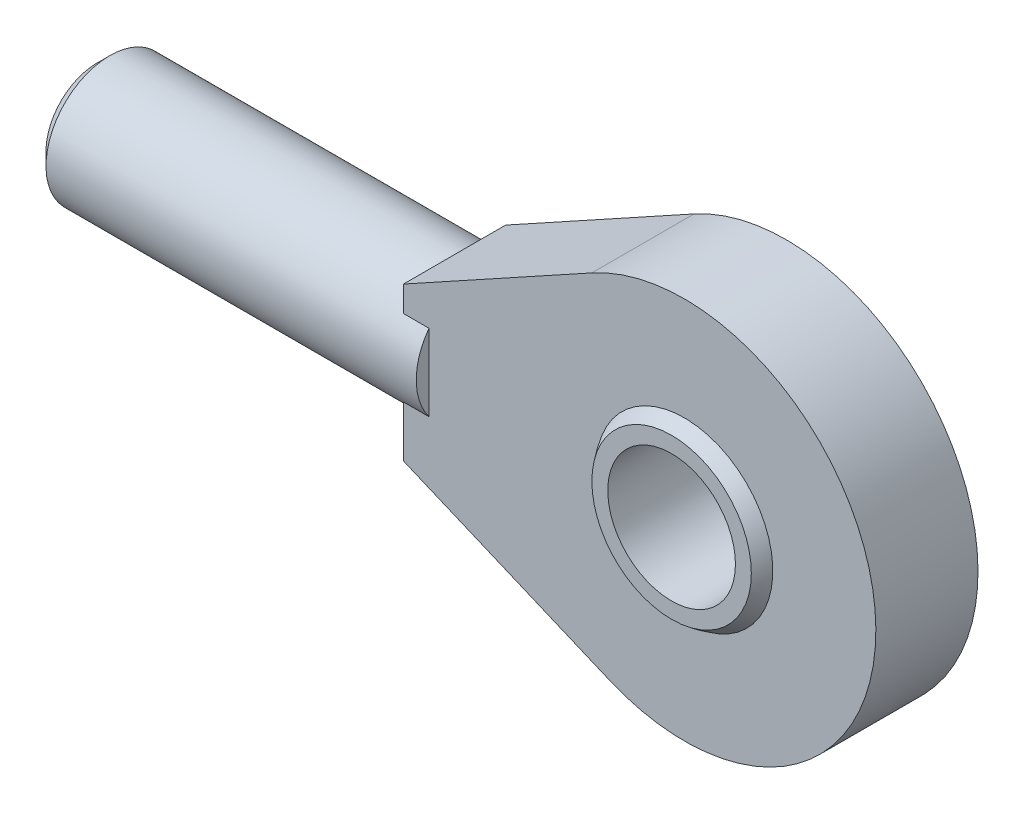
ISO-10303-21;
HEADER;
FILE_DESCRIPTION(('STEP AP214'),'2;1');
FILE_NAME('part.step','',(''),(''),'','','');
FILE_SCHEMA(('AUTOMOTIVE_DESIGN { 1 0 10303 214 1 1 1 1 }'));
ENDSEC;
DATA;
#1=APPLICATION_CONTEXT('core data for automotive mechanical design processes');
#2=APPLICATION_PROTOCOL_DEFINITION('international standard','automotive_design',2000,#1);
#3=PRODUCT_CONTEXT('',#1,'mechanical');
#4=PRODUCT('Part','Part','',(#3));
#5=PRODUCT_RELATED_PRODUCT_CATEGORY('part','',(#4));
#6=PRODUCT_DEFINITION_FORMATION('','',#4);
#7=PRODUCT_DEFINITION_CONTEXT('part definition',#1,'design');
#8=PRODUCT_DEFINITION('design','',#6,#7);
#9=PRODUCT_DEFINITION_SHAPE('','',#8);
#10=(LENGTH_UNIT() NAMED_UNIT(*) SI_UNIT(.MILLI.,.METRE.));
#11=(NAMED_UNIT(*) PLANE_ANGLE_UNIT() SI_UNIT($,.RADIAN.));
#12=(NAMED_UNIT(*) SI_UNIT($,.STERADIAN.) SOLID_ANGLE_UNIT());
#13=UNCERTAINTY_MEASURE_WITH_UNIT(LENGTH_MEASURE(1.E-05),#10,'distance_accuracy_value','');
#14=(GEOMETRIC_REPRESENTATION_CONTEXT(3) GLOBAL_UNCERTAINTY_ASSIGNED_CONTEXT((#13)) GLOBAL_UNIT_ASSIGNED_CONTEXT((#10,
#11,#12)) REPRESENTATION_CONTEXT('',''));
#15=CARTESIAN_POINT('',(0.,0.,0.));
#16=DIRECTION('',(0.,0.,1.));
#17=DIRECTION('',(1.,0.,0.));
#18=AXIS2_PLACEMENT_3D('',#15,#16,#17);
#19=CARTESIAN_POINT('',(50.,2.63677968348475E-13,-2.04003480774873E-12));
#20=DIRECTION('',(-1.,0.,0.));
#21=DIRECTION('',(0.,-0.999999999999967,0.));
#22=AXIS2_PLACEMENT_3D('',#19,#20,#21);
#23=SPHERICAL_SURFACE('',#22,8.);
#24=CARTESIAN_POINT('',(50.,2.63677968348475E-13,-2.04003480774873E-12));
#25=DIRECTION('',(0.,0.,-1.));
#26=DIRECTION('',(-1.,0.,0.));
#27=AXIS2_PLACEMENT_3D('',#24,#25,#26);
#28=SPHERICAL_SURFACE('',#27,8.);
#29=CARTESIAN_POINT('',(50.,2.63677968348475E-13,3.99999999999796));
#30=DIRECTION('',(0.,0.,-1.));
#31=DIRECTION('',(-1.,0.,0.));
#32=AXIS2_PLACEMENT_3D('',#29,#30,#31);
#33=CIRCLE('',#32,6.92820323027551);
#34=CARTESIAN_POINT('',(43.0717967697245,2.63677968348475E-13,3.99999999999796));
#35=VERTEX_POINT('',#34);
#36=EDGE_CURVE('E138',#35,#35,#33,.F.);
#37=ORIENTED_EDGE('',*,*,#36,.T.);
#38=EDGE_LOOP('',(#37));
#39=FACE_BOUND('',#38,.T.);
#40=CARTESIAN_POINT('',(50.,2.63677968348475E-13,4.99999999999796));
#41=DIRECTION('',(0.,0.,1.));
#42=DIRECTION('',(1.,0.,0.));
#43=AXIS2_PLACEMENT_3D('',#40,#41,#42);
#44=CIRCLE('',#43,6.2449979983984);
#45=CARTESIAN_POINT('',(56.2449979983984,2.63677968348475E-13,4.99999999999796));
#46=VERTEX_POINT('',#45);
#47=EDGE_CURVE('E155',#46,#46,#44,.T.);
#48=ORIENTED_EDGE('',*,*,#47,.F.);
#49=EDGE_LOOP('',(#48));
#50=FACE_BOUND('',#49,.T.);
#51=ADVANCED_FACE('F28',(#39,#50),#28,.T.);
#52=CARTESIAN_POINT('',(28.,5.00000000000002,4.));
#53=DIRECTION('',(1.,0.,0.));
#54=DIRECTION('',(0.,0.,-1.));
#55=AXIS2_PLACEMENT_3D('',#52,#53,#54);
#56=PLANE('',#55);
#57=DIRECTION('',(0.,-0.999999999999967,0.));
#58=VECTOR('',#57,1.);
#59=CARTESIAN_POINT('',(28.0000000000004,5.00000000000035,-4.));
#60=LINE('',#59,#58);
#61=CARTESIAN_POINT('',(28.0000000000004,5.00000000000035,-4.));
#62=VERTEX_POINT('',#61);
#63=CARTESIAN_POINT('',(28.,3.,-4.));
#64=VERTEX_POINT('',#63);
#65=EDGE_CURVE('E105',#62,#64,#60,.T.);
#66=ORIENTED_EDGE('',*,*,#65,.T.);
#67=CARTESIAN_POINT('',(28.,0.,0.));
#68=DIRECTION('',(1.,0.,0.));
#69=DIRECTION('',(0.,0.,-1.));
#70=AXIS2_PLACEMENT_3D('',#67,#68,#69);
#71=CIRCLE('',#70,5.);
#72=CARTESIAN_POINT('',(28.,5.00000000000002,0.));
#73=VERTEX_POINT('',#72);
#74=EDGE_CURVE('E151',#64,#73,#71,.T.);
#75=ORIENTED_EDGE('',*,*,#74,.T.);
#76=DIRECTION('',(0.,0.,-1.));
#77=VECTOR('',#76,1.);
#78=CARTESIAN_POINT('',(28.,5.00000000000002,4.));
#79=LINE('',#78,#77);
#80=EDGE_CURVE('E290',#73,#62,#79,.T.);
#81=ORIENTED_EDGE('',*,*,#80,.T.);
#82=EDGE_LOOP('',(#66,#75,#81));
#83=FACE_BOUND('',#82,.T.);
#84=ADVANCED_FACE('F174',(#83),#56,.F.);
#85=CARTESIAN_POINT('',(28.,5.00000000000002,4.));
#86=VERTEX_POINT('',#85);
#87=EDGE_CURVE('E291',#86,#73,#79,.T.);
#88=ORIENTED_EDGE('',*,*,#87,.T.);
#89=CARTESIAN_POINT('',(28.,3.,4.));
#90=VERTEX_POINT('',#89);
#91=EDGE_CURVE('E47',#73,#90,#71,.T.);
#92=ORIENTED_EDGE('',*,*,#91,.T.);
#93=DIRECTION('',(0.,-0.999999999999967,0.));
#94=VECTOR('',#93,1.);
#95=CARTESIAN_POINT('',(28.,5.00000000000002,4.));
#96=LINE('',#95,#94);
#97=EDGE_CURVE('E282',#86,#90,#96,.T.);
#98=ORIENTED_EDGE('',*,*,#97,.F.);
#99=EDGE_LOOP('',(#88,#92,#98));
#100=FACE_BOUND('',#99,.T.);
#101=ADVANCED_FACE('F183',(#100),#56,.F.);
#102=CARTESIAN_POINT('',(28.,-2.99999999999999,4.));
#103=VERTEX_POINT('',#102);
#104=CARTESIAN_POINT('',(28.,-6.99999999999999,3.99999999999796));
#105=VERTEX_POINT('',#104);
#106=EDGE_CURVE('E281',#103,#105,#96,.T.);
#107=ORIENTED_EDGE('',*,*,#106,.F.);
#108=CARTESIAN_POINT('',(28.0000000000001,-2.99999999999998,-4.));
#109=VERTEX_POINT('',#108);
#110=EDGE_CURVE('E102',#103,#109,#71,.T.);
#111=ORIENTED_EDGE('',*,*,#110,.T.);
#112=CARTESIAN_POINT('',(28.0000000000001,-7.,-4.00000000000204));
#113=VERTEX_POINT('',#112);
#114=EDGE_CURVE('E96',#109,#113,#60,.T.);
#115=ORIENTED_EDGE('',*,*,#114,.T.);
#116=DIRECTION('',(0.,0.,-1.));
#117=VECTOR('',#116,1.);
#118=CARTESIAN_POINT('',(28.,-6.99999999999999,3.99999999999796));
#119=LINE('',#118,#117);
#120=EDGE_CURVE('E101',#105,#113,#119,.T.);
#121=ORIENTED_EDGE('',*,*,#120,.F.);
#122=EDGE_LOOP('',(#107,#111,#115,#121));
#123=FACE_BOUND('',#122,.T.);
#124=ADVANCED_FACE('F99',(#123),#56,.F.);
#125=CARTESIAN_POINT('',(28.,-6.99999999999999,3.99999999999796));
#126=DIRECTION('',(0.388650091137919,0.921385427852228,0.));
#127=DIRECTION('',(-0.921385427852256,0.388650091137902,0.));
#128=AXIS2_PLACEMENT_3D('',#125,#126,#127);
#129=PLANE('',#128);
#130=DIRECTION('',(0.921385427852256,-0.388650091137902,0.));
#131=VECTOR('',#130,1.);
#132=CARTESIAN_POINT('',(28.0000000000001,-7.,-4.00000000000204));
#133=LINE('',#132,#131);
#134=CARTESIAN_POINT('',(44.1702486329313,-13.8207814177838,-4.));
#135=VERTEX_POINT('',#134);
#136=EDGE_CURVE('E109',#113,#135,#133,.T.);
#137=ORIENTED_EDGE('',*,*,#136,.T.);
#138=DIRECTION('',(0.,0.,-1.));
#139=VECTOR('',#138,1.);
#140=CARTESIAN_POINT('',(44.1702486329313,-13.8207814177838,3.99999999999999));
#141=LINE('',#140,#139);
#142=CARTESIAN_POINT('',(44.1702486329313,-13.8207814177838,3.99999999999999));
#143=VERTEX_POINT('',#142);
#144=EDGE_CURVE('E122',#143,#135,#141,.T.);
#145=ORIENTED_EDGE('',*,*,#144,.F.);
#146=DIRECTION('',(0.921385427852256,-0.388650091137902,0.));
#147=VECTOR('',#146,1.);
#148=CARTESIAN_POINT('',(28.,-6.99999999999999,3.99999999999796));
#149=LINE('',#148,#147);
#150=EDGE_CURVE('E120',#105,#143,#149,.T.);
#151=ORIENTED_EDGE('',*,*,#150,.F.);
#152=ORIENTED_EDGE('',*,*,#120,.T.);
#153=EDGE_LOOP('',(#137,#145,#151,#152));
#154=FACE_BOUND('',#153,.T.);
#155=ADVANCED_FACE('F119',(#154),#129,.F.);
#156=CARTESIAN_POINT('',(50.,2.63677968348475E-13,3.99999999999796));
#157=DIRECTION('',(0.,0.,-1.));
#158=DIRECTION('',(-1.,0.,0.));
#159=AXIS2_PLACEMENT_3D('',#156,#157,#158);
#160=CYLINDRICAL_SURFACE('',#159,15.);
#161=CARTESIAN_POINT('',(50.0000000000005,1.94289029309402E-13,-4.00000000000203));
#162=DIRECTION('',(0.,0.,1.));
#163=DIRECTION('',(1.,0.,0.));
#164=AXIS2_PLACEMENT_3D('',#161,#162,#163);
#165=CIRCLE('',#164,15.);
#166=CARTESIAN_POINT('',(42.7581973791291,13.1360684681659,-4.00000000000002));
#167=VERTEX_POINT('',#166);
#168=EDGE_CURVE('E113',#135,#167,#165,.T.);
#169=ORIENTED_EDGE('',*,*,#168,.T.);
#170=DIRECTION('',(0.,0.,-1.));
#171=VECTOR('',#170,1.);
#172=CARTESIAN_POINT('',(42.7581973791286,13.1360684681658,3.99999999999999));
#173=LINE('',#172,#171);
#174=CARTESIAN_POINT('',(42.7581973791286,13.1360684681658,3.99999999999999));
#175=VERTEX_POINT('',#174);
#176=EDGE_CURVE('E126',#175,#167,#173,.T.);
#177=ORIENTED_EDGE('',*,*,#176,.F.);
#178=CARTESIAN_POINT('',(50.,2.63677968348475E-13,3.99999999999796));
#179=DIRECTION('',(0.,0.,1.));
#180=DIRECTION('',(1.,0.,0.));
#181=AXIS2_PLACEMENT_3D('',#178,#179,#180);
#182=CIRCLE('',#181,15.);
#183=EDGE_CURVE('E286',#143,#175,#182,.T.);
#184=ORIENTED_EDGE('',*,*,#183,.F.);
#185=ORIENTED_EDGE('',*,*,#144,.T.);
#186=EDGE_LOOP('',(#169,#177,#184,#185));
#187=FACE_BOUND('',#186,.T.);
#188=ADVANCED_FACE('F199',(#187),#160,.T.);
#189=CARTESIAN_POINT('',(42.7581973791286,13.1360684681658,3.99999999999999));
#190=DIRECTION('',(0.482786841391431,-0.875737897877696,0.));
#191=DIRECTION('',(0.875737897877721,0.482786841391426,0.));
#192=AXIS2_PLACEMENT_3D('',#189,#190,#191);
#193=PLANE('',#192);
#194=DIRECTION('',(-0.875737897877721,-0.482786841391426,0.));
#195=VECTOR('',#194,1.);
#196=CARTESIAN_POINT('',(42.7581973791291,13.1360684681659,-4.00000000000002));
#197=LINE('',#196,#195);
#198=EDGE_CURVE('E278',#167,#62,#197,.T.);
#199=ORIENTED_EDGE('',*,*,#198,.T.);
#200=ORIENTED_EDGE('',*,*,#80,.F.);
#201=ORIENTED_EDGE('',*,*,#87,.F.);
#202=DIRECTION('',(-0.875737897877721,-0.482786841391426,0.));
#203=VECTOR('',#202,1.);
#204=CARTESIAN_POINT('',(42.7581973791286,13.1360684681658,3.99999999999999));
#205=LINE('',#204,#203);
#206=EDGE_CURVE('E288',#175,#86,#205,.T.);
#207=ORIENTED_EDGE('',*,*,#206,.F.);
#208=ORIENTED_EDGE('',*,*,#176,.T.);
#209=EDGE_LOOP('',(#199,#200,#201,#207,#208));
#210=FACE_BOUND('',#209,.T.);
#211=ADVANCED_FACE('F190',(#210),#193,.F.);
#212=CARTESIAN_POINT('',(50.,2.63677968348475E-13,-2.04003480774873E-12));
#213=DIRECTION('',(0.,0.,1.));
#214=DIRECTION('',(1.,0.,0.));
#215=AXIS2_PLACEMENT_3D('',#212,#213,#214);
#216=SPHERICAL_SURFACE('',#215,8.);
#217=CARTESIAN_POINT('',(50.0000000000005,1.94289029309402E-13,-5.00000000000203));
#218=DIRECTION('',(0.,0.,1.));
#219=DIRECTION('',(1.,0.,0.));
#220=AXIS2_PLACEMENT_3D('',#217,#218,#219);
#221=CIRCLE('',#220,6.2449979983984);
#222=CARTESIAN_POINT('',(56.2449979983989,1.94289029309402E-13,-5.00000000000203));
#223=VERTEX_POINT('',#222);
#224=EDGE_CURVE('E152',#223,#223,#221,.T.);
#225=ORIENTED_EDGE('',*,*,#224,.T.);
#226=EDGE_LOOP('',(#225));
#227=FACE_BOUND('',#226,.T.);
#228=CARTESIAN_POINT('',(50.0000000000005,1.94289029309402E-13,-4.00000000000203));
#229=DIRECTION('',(0.,0.,1.));
#230=DIRECTION('',(1.,0.,0.));
#231=AXIS2_PLACEMENT_3D('',#228,#229,#230);
#232=CIRCLE('',#231,6.92820323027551);
#233=CARTESIAN_POINT('',(56.928203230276,1.94289029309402E-13,-4.00000000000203));
#234=VERTEX_POINT('',#233);
#235=EDGE_CURVE('E135',#234,#234,#232,.F.);
#236=ORIENTED_EDGE('',*,*,#235,.T.);
#237=EDGE_LOOP('',(#236));
#238=FACE_BOUND('',#237,.T.);
#239=ADVANCED_FACE('F177',(#227,#238),#216,.T.);
#240=CARTESIAN_POINT('',(54.,4.0000000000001,3.99999999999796));
#241=DIRECTION('',(0.,0.,-1.));
#242=DIRECTION('',(-1.,0.,0.));
#243=AXIS2_PLACEMENT_3D('',#240,#241,#242);
#244=PLANE('',#243);
#245=DIRECTION('',(-1.,0.,0.));
#246=VECTOR('',#245,1.);
#247=CARTESIAN_POINT('',(28.,3.,4.));
#248=LINE('',#247,#246);
#249=CARTESIAN_POINT('',(29.9999999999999,3.00000000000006,4.));
#250=VERTEX_POINT('',#249);
#251=EDGE_CURVE('E43',#250,#90,#248,.T.);
#252=ORIENTED_EDGE('',*,*,#251,.F.);
#253=DIRECTION('',(0.,-0.999999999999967,0.));
#254=VECTOR('',#253,1.);
#255=CARTESIAN_POINT('',(29.9999999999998,4.00000000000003,4.));
#256=LINE('',#255,#254);
#257=CARTESIAN_POINT('',(30.,-2.99999999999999,4.));
#258=VERTEX_POINT('',#257);
#259=EDGE_CURVE('E142',#250,#258,#256,.T.);
#260=ORIENTED_EDGE('',*,*,#259,.T.);
#261=DIRECTION('',(-1.,0.,0.));
#262=VECTOR('',#261,1.);
#263=CARTESIAN_POINT('',(28.,-2.99999999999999,4.));
#264=LINE('',#263,#262);
#265=EDGE_CURVE('E132',#103,#258,#264,.F.);
#266=ORIENTED_EDGE('',*,*,#265,.F.);
#267=ORIENTED_EDGE('',*,*,#106,.T.);
#268=ORIENTED_EDGE('',*,*,#150,.T.);
#269=ORIENTED_EDGE('',*,*,#183,.T.);
#270=ORIENTED_EDGE('',*,*,#206,.T.);
#271=ORIENTED_EDGE('',*,*,#97,.T.);
#272=EDGE_LOOP('',(#252,#260,#266,#267,#268,#269,#270,#271));
#273=FACE_BOUND('',#272,.T.);
#274=ORIENTED_EDGE('',*,*,#36,.F.);
#275=EDGE_LOOP('',(#274));
#276=FACE_BOUND('',#275,.T.);
#277=ADVANCED_FACE('F189',(#273,#276),#244,.F.);
#278=CARTESIAN_POINT('',(54.0000000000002,-3.99999999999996,-4.00000000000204));
#279=DIRECTION('',(0.,0.,1.));
#280=DIRECTION('',(1.,0.,0.));
#281=AXIS2_PLACEMENT_3D('',#278,#279,#280);
#282=PLANE('',#281);
#283=ORIENTED_EDGE('',*,*,#235,.F.);
#284=EDGE_LOOP('',(#283));
#285=FACE_BOUND('',#284,.T.);
#286=DIRECTION('',(0.,0.999999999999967,0.));
#287=VECTOR('',#286,1.);
#288=CARTESIAN_POINT('',(30.0000000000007,-3.99999999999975,-4.));
#289=LINE('',#288,#287);
#290=CARTESIAN_POINT('',(30.0000000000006,-2.99999999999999,-4.));
#291=VERTEX_POINT('',#290);
#292=CARTESIAN_POINT('',(30.0000000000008,3.00000000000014,-4.));
#293=VERTEX_POINT('',#292);
#294=EDGE_CURVE('E145',#291,#293,#289,.T.);
#295=ORIENTED_EDGE('',*,*,#294,.T.);
#296=DIRECTION('',(-1.,0.,0.));
#297=VECTOR('',#296,1.);
#298=CARTESIAN_POINT('',(28.,3.,-4.));
#299=LINE('',#298,#297);
#300=EDGE_CURVE('E124',#293,#64,#299,.T.);
#301=ORIENTED_EDGE('',*,*,#300,.T.);
#302=ORIENTED_EDGE('',*,*,#65,.F.);
#303=ORIENTED_EDGE('',*,*,#198,.F.);
#304=ORIENTED_EDGE('',*,*,#168,.F.);
#305=ORIENTED_EDGE('',*,*,#136,.F.);
#306=ORIENTED_EDGE('',*,*,#114,.F.);
#307=DIRECTION('',(-1.,0.,0.));
#308=VECTOR('',#307,1.);
#309=CARTESIAN_POINT('',(28.0000000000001,-2.99999999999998,-4.));
#310=LINE('',#309,#308);
#311=EDGE_CURVE('E121',#109,#291,#310,.F.);
#312=ORIENTED_EDGE('',*,*,#311,.T.);
#313=EDGE_LOOP('',(#295,#301,#302,#303,#304,#305,#306,#312));
#314=FACE_BOUND('',#313,.T.);
#315=ADVANCED_FACE('F111',(#285,#314),#282,.F.);
#316=CARTESIAN_POINT('',(30.0000000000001,0.,0.));
#317=DIRECTION('',(1.,0.,0.));
#318=DIRECTION('',(0.,0.,-1.));
#319=AXIS2_PLACEMENT_3D('',#316,#317,#318);
#320=PLANE('',#319);
#321=ORIENTED_EDGE('',*,*,#259,.F.);
#322=CARTESIAN_POINT('',(30.0000000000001,0.,0.));
#323=DIRECTION('',(1.,0.,0.));
#324=DIRECTION('',(0.,0.,-1.));
#325=AXIS2_PLACEMENT_3D('',#322,#323,#324);
#326=CIRCLE('',#325,5.);
#327=EDGE_CURVE('E147',#250,#258,#326,.T.);
#328=ORIENTED_EDGE('',*,*,#327,.T.);
#329=EDGE_LOOP('',(#321,#328));
#330=FACE_BOUND('',#329,.T.);
#331=ADVANCED_FACE('F206',(#330),#320,.T.);
#332=CARTESIAN_POINT('',(28.,0.,0.));
#333=DIRECTION('',(-1.,0.,0.));
#334=DIRECTION('',(0.,0.,1.));
#335=AXIS2_PLACEMENT_3D('',#332,#333,#334);
#336=CYLINDRICAL_SURFACE('',#335,5.);
#337=CARTESIAN_POINT('',(1.00000000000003,0.,0.));
#338=DIRECTION('',(1.,0.,0.));
#339=DIRECTION('',(0.,0.,-1.));
#340=AXIS2_PLACEMENT_3D('',#337,#338,#339);
#341=CIRCLE('',#340,5.);
#342=CARTESIAN_POINT('',(1.00000000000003,0.,-5.));
#343=VERTEX_POINT('',#342);
#344=EDGE_CURVE('E36',#343,#343,#341,.T.);
#345=ORIENTED_EDGE('',*,*,#344,.T.);
#346=EDGE_LOOP('',(#345));
#347=FACE_BOUND('',#346,.T.);
#348=ORIENTED_EDGE('',*,*,#327,.F.);
#349=ORIENTED_EDGE('',*,*,#251,.T.);
#350=ORIENTED_EDGE('',*,*,#91,.F.);
#351=ORIENTED_EDGE('',*,*,#74,.F.);
#352=ORIENTED_EDGE('',*,*,#300,.F.);
#353=EDGE_CURVE('E141',#291,#293,#326,.T.);
#354=ORIENTED_EDGE('',*,*,#353,.F.);
#355=ORIENTED_EDGE('',*,*,#311,.F.);
#356=ORIENTED_EDGE('',*,*,#110,.F.);
#357=ORIENTED_EDGE('',*,*,#265,.T.);
#358=EDGE_LOOP('',(#348,#349,#350,#351,#352,#354,#355,#356,#357));
#359=FACE_BOUND('',#358,.T.);
#360=ADVANCED_FACE('F30',(#347,#359),#336,.T.);
#361=CARTESIAN_POINT('',(0.,0.,0.));
#362=DIRECTION('',(1.,0.,0.));
#363=DIRECTION('',(0.,0.,-1.));
#364=AXIS2_PLACEMENT_3D('',#361,#362,#363);
#365=PLANE('',#364);
#366=CARTESIAN_POINT('',(0.,0.,0.));
#367=DIRECTION('',(1.,0.,0.));
#368=DIRECTION('',(0.,0.,-1.));
#369=AXIS2_PLACEMENT_3D('',#366,#367,#368);
#370=CIRCLE('',#369,3.99999999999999);
#371=CARTESIAN_POINT('',(0.,0.,-3.99999999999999));
#372=VERTEX_POINT('',#371);
#373=EDGE_CURVE('E11',#372,#372,#370,.F.);
#374=ORIENTED_EDGE('',*,*,#373,.T.);
#375=EDGE_LOOP('',(#374));
#376=FACE_BOUND('',#375,.T.);
#377=ADVANCED_FACE('F216',(#376),#365,.F.);
#378=ORIENTED_EDGE('',*,*,#294,.F.);
#379=ORIENTED_EDGE('',*,*,#353,.T.);
#380=EDGE_LOOP('',(#378,#379));
#381=FACE_BOUND('',#380,.T.);
#382=ADVANCED_FACE('F213',(#381),#320,.T.);
#383=CARTESIAN_POINT('',(43.7550020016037,-7.99999999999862,-5.));
#384=DIRECTION('',(0.,0.,1.));
#385=DIRECTION('',(1.,0.,0.));
#386=AXIS2_PLACEMENT_3D('',#383,#384,#385);
#387=PLANE('',#386);
#388=CARTESIAN_POINT('',(50.0000000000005,1.94289029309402E-13,-5.00000000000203));
#389=DIRECTION('',(0.,0.,1.));
#390=DIRECTION('',(1.,0.,0.));
#391=AXIS2_PLACEMENT_3D('',#388,#389,#390);
#392=CIRCLE('',#391,5.);
#393=CARTESIAN_POINT('',(55.0000000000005,1.94289029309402E-13,-5.00000000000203));
#394=VERTEX_POINT('',#393);
#395=EDGE_CURVE('E106',#394,#394,#392,.T.);
#396=ORIENTED_EDGE('',*,*,#395,.T.);
#397=EDGE_LOOP('',(#396));
#398=FACE_BOUND('',#397,.T.);
#399=ORIENTED_EDGE('',*,*,#224,.F.);
#400=EDGE_LOOP('',(#399));
#401=FACE_BOUND('',#400,.T.);
#402=ADVANCED_FACE('F215',(#398,#401),#387,.F.);
#403=CARTESIAN_POINT('',(43.7550020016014,-7.99999999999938,4.99999999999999));
#404=DIRECTION('',(0.,0.,1.));
#405=DIRECTION('',(1.,0.,0.));
#406=AXIS2_PLACEMENT_3D('',#403,#404,#405);
#407=PLANE('',#406);
#408=CARTESIAN_POINT('',(50.,2.63677968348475E-13,4.99999999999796));
#409=DIRECTION('',(0.,0.,1.));
#410=DIRECTION('',(1.,0.,0.));
#411=AXIS2_PLACEMENT_3D('',#408,#409,#410);
#412=CIRCLE('',#411,5.);
#413=CARTESIAN_POINT('',(55.,2.63677968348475E-13,4.99999999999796));
#414=VERTEX_POINT('',#413);
#415=EDGE_CURVE('E269',#414,#414,#412,.T.);
#416=ORIENTED_EDGE('',*,*,#415,.F.);
#417=EDGE_LOOP('',(#416));
#418=FACE_BOUND('',#417,.T.);
#419=ORIENTED_EDGE('',*,*,#47,.T.);
#420=EDGE_LOOP('',(#419));
#421=FACE_BOUND('',#420,.T.);
#422=ADVANCED_FACE('F169',(#418,#421),#407,.T.);
#423=CARTESIAN_POINT('',(50.0000000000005,1.94289029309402E-13,-5.00000000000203));
#424=DIRECTION('',(0.,0.,1.));
#425=DIRECTION('',(1.,0.,0.));
#426=AXIS2_PLACEMENT_3D('',#423,#424,#425);
#427=CYLINDRICAL_SURFACE('',#426,5.);
#428=ORIENTED_EDGE('',*,*,#395,.F.);
#429=EDGE_LOOP('',(#428));
#430=FACE_BOUND('',#429,.T.);
#431=ORIENTED_EDGE('',*,*,#415,.T.);
#432=EDGE_LOOP('',(#431));
#433=FACE_BOUND('',#432,.T.);
#434=ADVANCED_FACE('F163',(#430,#433),#427,.F.);
#435=CARTESIAN_POINT('',(1.00000000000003,0.,0.));
#436=DIRECTION('',(1.,0.,0.));
#437=DIRECTION('',(0.,0.,-1.));
#438=AXIS2_PLACEMENT_3D('',#435,#436,#437);
#439=CONICAL_SURFACE('',#438,5.,0.785398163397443);
#440=ORIENTED_EDGE('',*,*,#373,.F.);
#441=EDGE_LOOP('',(#440));
#442=FACE_BOUND('',#441,.T.);
#443=ORIENTED_EDGE('',*,*,#344,.F.);
#444=EDGE_LOOP('',(#443));
#445=FACE_BOUND('',#444,.T.);
#446=ADVANCED_FACE('F161',(#442,#445),#439,.T.);
#447=CLOSED_SHELL('',(#51,#84,#101,#124,#155,#188,#211,#239,#277,#315,#331,#360,#377,#382,#402,
#422,#434,#446));
#448=MANIFOLD_SOLID_BREP('B2',#447);
#449=ADVANCED_BREP_SHAPE_REPRESENTATION('',(#18,#448),#14);
#450=SHAPE_DEFINITION_REPRESENTATION(#9,#449);
ENDSEC;
END-ISO-10303-21;
